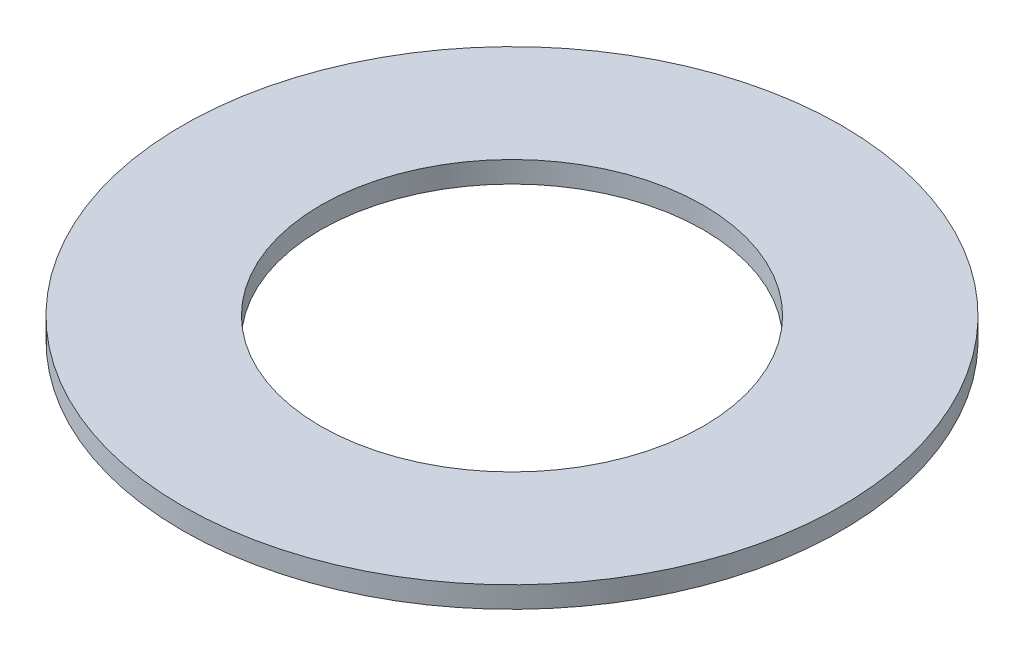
from build123d import *

# Parameters (mm, degrees)
SKETCH1_W = 1.651
SKETCH1_H = 0.254


with BuildPart() as part:
    # Sketch1 → Revolve1 (revolve)
    with BuildSketch(Plane(origin=(0, 0, 0), x_dir=(0, 0, -1), z_dir=(1, 0, 0)), mode=Mode.PRIVATE) as revolve1_sk:
        with Locations((3.1115, 0)):
            Rectangle(SKETCH1_W, SKETCH1_H)
    revolve(revolve1_sk.sketch.rotate(Axis((0, 14.869901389, 0), (0, -1, 0)), 180), axis=Axis((0, 14.869901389, 0), (0, -1, 0)))


solid = part.part
